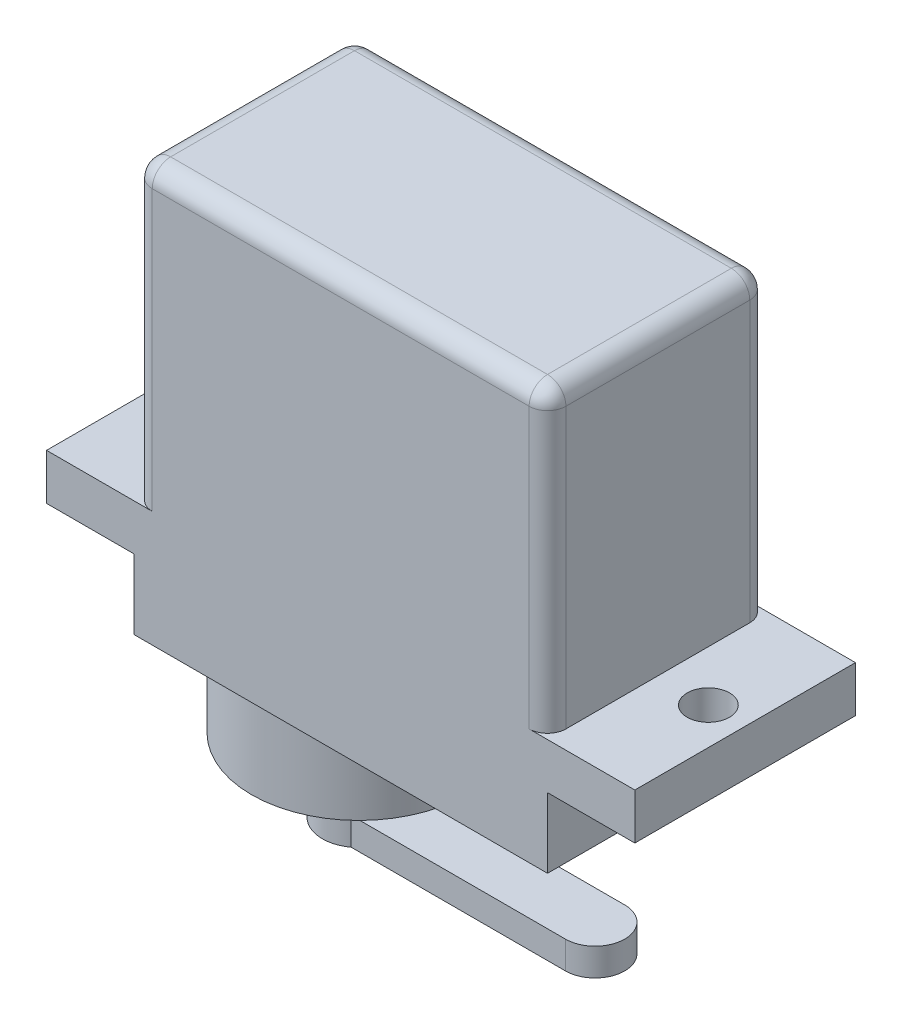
from build123d import *

# Parameters (mm, degrees)
EXTRUDE_1_DEPTH     = 6
SKETCH_2_R          = 1.15
CUT_EXTRUDE_1_DEPTH = 26.331600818
SKETCH_3_R          = 5.85
EXTRUDE_2_DEPTH     = 4.5
SKETCH_4_R          = 2
EXTRUDE_3_DEPTH     = 4
EXTRUDE_4_DEPTH     = 1.5
FILLET_1_R          = 1


with BuildPart() as part:
    # Sketch 1 → Extrude 1 (new, symmetric)
    with BuildSketch(Plane.XY):
        Polygon((0, 0), (-11.25, 0), (-11.25, 3.8), (-16, 3.8), (-16, 6.3), (-11.25, 6.3), (-11.25, 22.5), (11.25, 22.5), (11.25, 6.3), (16, 6.3), (16, 3.8), (11.25, 3.8), (11.25, 0), align=None)
    extrude(amount=EXTRUDE_1_DEPTH, both=True)

    # Sketch 2 → Cut-Extrude 1 (cut, through all)
    with BuildSketch(Plane.XZ.offset(-3.8)):
        with Locations((-14, 0)):
            Circle(SKETCH_2_R)
        with Locations((14, 0)):
            Circle(SKETCH_2_R)
    extrude(amount=-CUT_EXTRUDE_1_DEPTH, mode=Mode.SUBTRACT)

    # Sketch 3 → Extrude 2 (add)
    with BuildSketch(Plane.XZ):
        with Locations((-5, 0)):
            Circle(SKETCH_3_R)
    extrude(amount=EXTRUDE_2_DEPTH)

    # Sketch 4 → Extrude 3 (add)
    with BuildSketch(Plane.XZ.offset(4.5)):
        with Locations((-5, 0)):
            Circle(SKETCH_4_R)
    extrude(amount=EXTRUDE_3_DEPTH)

    # Sketch 5 → Extrude 4 (add)
    with BuildSketch(Plane.XZ.offset(8.5)):
        with BuildLine():
            Line((-5, 1.611538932), (7.837939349, 1.611538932))
            ThreePointArc((7.837939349, 1.611538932), (9.449478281, 0), (7.837939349, -1.611538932))
            Line((7.837939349, -1.611538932), (-5, -1.611538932))
            ThreePointArc((-5, -1.611538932), (-6.611538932, 0), (-5, 1.611538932))
        make_face()
    extrude(amount=-EXTRUDE_4_DEPTH)

    # Fillet 1
    fillet_1_edges = [part.edges().sort_by_distance(p)[0] for p in [
        (-11.25, 14.4, -6),
        (0, 22.5, -6),
        (11.25, 14.4, -6),
        (11.25, 14.4, 6),
        (-11.25, 22.5, 0),
        (11.25, 22.5, 0),
        (0, 22.5, 6),
        (-11.25, 14.4, 6),
    ]]
    fillet(fillet_1_edges, radius=FILLET_1_R)


solid = part.part
